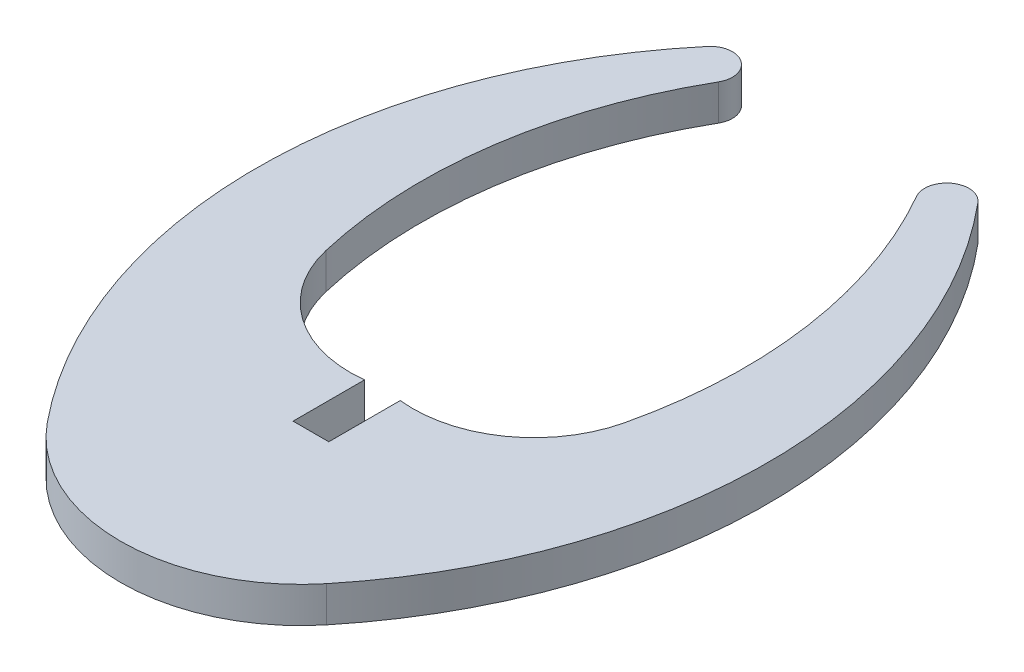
ISO-10303-21;
HEADER;
FILE_DESCRIPTION(('STEP AP214'),'2;1');
FILE_NAME('part.step','',(''),(''),'','','');
FILE_SCHEMA(('AUTOMOTIVE_DESIGN { 1 0 10303 214 1 1 1 1 }'));
ENDSEC;
DATA;
#1=APPLICATION_CONTEXT('core data for automotive mechanical design processes');
#2=APPLICATION_PROTOCOL_DEFINITION('international standard','automotive_design',2000,#1);
#3=PRODUCT_CONTEXT('',#1,'mechanical');
#4=PRODUCT('Part','Part','',(#3));
#5=PRODUCT_RELATED_PRODUCT_CATEGORY('part','',(#4));
#6=PRODUCT_DEFINITION_FORMATION('','',#4);
#7=PRODUCT_DEFINITION_CONTEXT('part definition',#1,'design');
#8=PRODUCT_DEFINITION('design','',#6,#7);
#9=PRODUCT_DEFINITION_SHAPE('','',#8);
#10=(LENGTH_UNIT() NAMED_UNIT(*) SI_UNIT(.MILLI.,.METRE.));
#11=(NAMED_UNIT(*) PLANE_ANGLE_UNIT() SI_UNIT($,.RADIAN.));
#12=(NAMED_UNIT(*) SI_UNIT($,.STERADIAN.) SOLID_ANGLE_UNIT());
#13=UNCERTAINTY_MEASURE_WITH_UNIT(LENGTH_MEASURE(1.E-05),#10,'distance_accuracy_value','');
#14=(GEOMETRIC_REPRESENTATION_CONTEXT(3) GLOBAL_UNCERTAINTY_ASSIGNED_CONTEXT((#13)) GLOBAL_UNIT_ASSIGNED_CONTEXT((#10,
#11,#12)) REPRESENTATION_CONTEXT('',''));
#15=CARTESIAN_POINT('',(0.,0.,0.));
#16=DIRECTION('',(0.,0.,1.));
#17=DIRECTION('',(1.,0.,0.));
#18=AXIS2_PLACEMENT_3D('',#15,#16,#17);
#19=CARTESIAN_POINT('',(-41813.701197,3.,-18401.092482));
#20=DIRECTION('',(-0.999999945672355,0.,0.000329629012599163));
#21=DIRECTION('',(0.000329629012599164,0.,0.999999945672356));
#22=AXIS2_PLACEMENT_3D('',#19,#20,#21);
#23=PLANE('',#22);
#24=DIRECTION('',(-0.000329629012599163,0.,-0.999999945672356));
#25=VECTOR('',#24,1.);
#26=CARTESIAN_POINT('',(-41813.701197,0.,-18401.092482));
#27=LINE('',#26,#25);
#28=CARTESIAN_POINT('',(-41813.699219,0.,-18395.091797));
#29=VERTEX_POINT('',#28);
#30=CARTESIAN_POINT('',(-41813.701197,0.,-18401.092482));
#31=VERTEX_POINT('',#30);
#32=EDGE_CURVE('E156',#29,#31,#27,.T.);
#33=ORIENTED_EDGE('',*,*,#32,.T.);
#34=DIRECTION('',(0.,-1.,0.));
#35=VECTOR('',#34,1.);
#36=CARTESIAN_POINT('',(-41813.701197,3.,-18401.092482));
#37=LINE('',#36,#35);
#38=CARTESIAN_POINT('',(-41813.701197,3.,-18401.092482));
#39=VERTEX_POINT('',#38);
#40=EDGE_CURVE('E11',#39,#31,#37,.T.);
#41=ORIENTED_EDGE('',*,*,#40,.F.);
#42=DIRECTION('',(-0.000329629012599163,0.,-0.999999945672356));
#43=VECTOR('',#42,1.);
#44=CARTESIAN_POINT('',(-41813.701197,3.,-18401.092482));
#45=LINE('',#44,#43);
#46=CARTESIAN_POINT('',(-41813.699219,3.,-18395.091797));
#47=VERTEX_POINT('',#46);
#48=EDGE_CURVE('E178',#47,#39,#45,.T.);
#49=ORIENTED_EDGE('',*,*,#48,.F.);
#50=DIRECTION('',(0.,-1.,0.));
#51=VECTOR('',#50,1.);
#52=CARTESIAN_POINT('',(-41813.699219,3.,-18395.091797));
#53=LINE('',#52,#51);
#54=EDGE_CURVE('E152',#47,#29,#53,.T.);
#55=ORIENTED_EDGE('',*,*,#54,.T.);
#56=EDGE_LOOP('',(#33,#41,#49,#55));
#57=FACE_BOUND('',#56,.T.);
#58=ADVANCED_FACE('F36',(#57),#23,.F.);
#59=CARTESIAN_POINT('',(-41814.8306231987,3.,-18411.1923649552));
#60=DIRECTION('',(0.,-1.,0.));
#61=DIRECTION('',(0.,0.,-1.));
#62=AXIS2_PLACEMENT_3D('',#59,#60,#61);
#63=CYLINDRICAL_SURFACE('',#62,10.1628361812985);
#64=CARTESIAN_POINT('',(-41814.8306231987,0.,-18411.1923649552));
#65=DIRECTION('',(0.,-1.,0.));
#66=DIRECTION('',(0.,0.,1.));
#67=AXIS2_PLACEMENT_3D('',#64,#65,#66);
#68=CIRCLE('',#67,10.1628361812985);
#69=CARTESIAN_POINT('',(-41824.726251,0.,-18408.877243));
#70=VERTEX_POINT('',#69);
#71=EDGE_CURVE('E159',#31,#70,#68,.T.);
#72=ORIENTED_EDGE('',*,*,#71,.T.);
#73=DIRECTION('',(0.,-1.,0.));
#74=VECTOR('',#73,1.);
#75=CARTESIAN_POINT('',(-41824.726251,3.,-18408.877243));
#76=LINE('',#75,#74);
#77=CARTESIAN_POINT('',(-41824.726251,3.,-18408.877243));
#78=VERTEX_POINT('',#77);
#79=EDGE_CURVE('E44',#78,#70,#76,.T.);
#80=ORIENTED_EDGE('',*,*,#79,.F.);
#81=CARTESIAN_POINT('',(-41814.8306231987,3.,-18411.1923649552));
#82=DIRECTION('',(0.,-1.,0.));
#83=DIRECTION('',(0.,0.,1.));
#84=AXIS2_PLACEMENT_3D('',#81,#82,#83);
#85=CIRCLE('',#84,10.1628361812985);
#86=EDGE_CURVE('E107',#39,#78,#85,.T.);
#87=ORIENTED_EDGE('',*,*,#86,.F.);
#88=ORIENTED_EDGE('',*,*,#40,.T.);
#89=EDGE_LOOP('',(#72,#80,#87,#88));
#90=FACE_BOUND('',#89,.T.);
#91=ADVANCED_FACE('F256',(#90),#63,.F.);
#92=CARTESIAN_POINT('',(-41786.1759224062,3.,-18417.9052855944));
#93=DIRECTION('',(0.,-1.,0.));
#94=DIRECTION('',(0.,0.,-1.));
#95=AXIS2_PLACEMENT_3D('',#92,#93,#94);
#96=CYLINDRICAL_SURFACE('',#95,39.5933502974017);
#97=CARTESIAN_POINT('',(-41786.1759224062,0.,-18417.9052855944));
#98=DIRECTION('',(0.,-1.,0.));
#99=DIRECTION('',(0.,0.,1.));
#100=AXIS2_PLACEMENT_3D('',#97,#98,#99);
#101=CIRCLE('',#100,39.5933502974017);
#102=CARTESIAN_POINT('',(-41820.511795,0.,-18437.620286));
#103=VERTEX_POINT('',#102);
#104=EDGE_CURVE('E161',#70,#103,#101,.T.);
#105=ORIENTED_EDGE('',*,*,#104,.T.);
#106=DIRECTION('',(0.,-1.,0.));
#107=VECTOR('',#106,1.);
#108=CARTESIAN_POINT('',(-41820.511795,3.,-18437.620286));
#109=LINE('',#108,#107);
#110=CARTESIAN_POINT('',(-41820.511795,3.,-18437.620286));
#111=VERTEX_POINT('',#110);
#112=EDGE_CURVE('E197',#111,#103,#109,.T.);
#113=ORIENTED_EDGE('',*,*,#112,.F.);
#114=CARTESIAN_POINT('',(-41786.1759224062,3.,-18417.9052855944));
#115=DIRECTION('',(0.,-1.,0.));
#116=DIRECTION('',(0.,0.,1.));
#117=AXIS2_PLACEMENT_3D('',#114,#115,#116);
#118=CIRCLE('',#117,39.5933502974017);
#119=EDGE_CURVE('E205',#78,#111,#118,.T.);
#120=ORIENTED_EDGE('',*,*,#119,.F.);
#121=ORIENTED_EDGE('',*,*,#79,.T.);
#122=EDGE_LOOP('',(#105,#113,#120,#121));
#123=FACE_BOUND('',#122,.T.);
#124=ADVANCED_FACE('F203',(#123),#96,.F.);
#125=CARTESIAN_POINT('',(-41822.1254187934,3.,-18438.5452138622));
#126=DIRECTION('',(0.,-1.,0.));
#127=DIRECTION('',(0.,0.,-1.));
#128=AXIS2_PLACEMENT_3D('',#125,#126,#127);
#129=CYLINDRICAL_SURFACE('',#128,1.85991217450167);
#130=CARTESIAN_POINT('',(-41822.1254187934,0.,-18438.5452138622));
#131=DIRECTION('',(0.,1.,0.));
#132=DIRECTION('',(0.,0.,1.));
#133=AXIS2_PLACEMENT_3D('',#130,#131,#132);
#134=CIRCLE('',#133,1.85991217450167);
#135=CARTESIAN_POINT('',(-41823.551759,0.,-18439.738875));
#136=VERTEX_POINT('',#135);
#137=EDGE_CURVE('E163',#103,#136,#134,.T.);
#138=ORIENTED_EDGE('',*,*,#137,.T.);
#139=DIRECTION('',(0.,-1.,0.));
#140=VECTOR('',#139,1.);
#141=CARTESIAN_POINT('',(-41823.551759,3.,-18439.738875));
#142=LINE('',#141,#140);
#143=CARTESIAN_POINT('',(-41823.551759,3.,-18439.738875));
#144=VERTEX_POINT('',#143);
#145=EDGE_CURVE('E194',#144,#136,#142,.T.);
#146=ORIENTED_EDGE('',*,*,#145,.F.);
#147=CARTESIAN_POINT('',(-41822.1254187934,3.,-18438.5452138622));
#148=DIRECTION('',(0.,1.,0.));
#149=DIRECTION('',(0.,0.,1.));
#150=AXIS2_PLACEMENT_3D('',#147,#148,#149);
#151=CIRCLE('',#150,1.85991217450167);
#152=EDGE_CURVE('E223',#111,#144,#151,.T.);
#153=ORIENTED_EDGE('',*,*,#152,.F.);
#154=ORIENTED_EDGE('',*,*,#112,.T.);
#155=EDGE_LOOP('',(#138,#146,#153,#154));
#156=FACE_BOUND('',#155,.T.);
#157=ADVANCED_FACE('F214',(#156),#129,.T.);
#158=CARTESIAN_POINT('',(-41790.429705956,3.,-18411.9835689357));
#159=DIRECTION('',(0.,-1.,0.));
#160=DIRECTION('',(0.,0.,-1.));
#161=AXIS2_PLACEMENT_3D('',#158,#159,#160);
#162=CYLINDRICAL_SURFACE('',#161,43.2137410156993);
#163=CARTESIAN_POINT('',(-41790.429705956,0.,-18411.9835689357));
#164=DIRECTION('',(0.,1.,0.));
#165=DIRECTION('',(0.,0.,1.));
#166=AXIS2_PLACEMENT_3D('',#163,#164,#165);
#167=CIRCLE('',#166,43.2137410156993);
#168=CARTESIAN_POINT('',(-41823.929996,0.,-18384.685987));
#169=VERTEX_POINT('',#168);
#170=EDGE_CURVE('E165',#136,#169,#167,.T.);
#171=ORIENTED_EDGE('',*,*,#170,.T.);
#172=DIRECTION('',(0.,-1.,0.));
#173=VECTOR('',#172,1.);
#174=CARTESIAN_POINT('',(-41823.929996,3.,-18384.685987));
#175=LINE('',#174,#173);
#176=CARTESIAN_POINT('',(-41823.929996,3.,-18384.685987));
#177=VERTEX_POINT('',#176);
#178=EDGE_CURVE('E191',#177,#169,#175,.T.);
#179=ORIENTED_EDGE('',*,*,#178,.F.);
#180=CARTESIAN_POINT('',(-41790.429705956,3.,-18411.9835689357));
#181=DIRECTION('',(0.,1.,0.));
#182=DIRECTION('',(0.,0.,1.));
#183=AXIS2_PLACEMENT_3D('',#180,#181,#182);
#184=CIRCLE('',#183,43.2137410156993);
#185=EDGE_CURVE('E220',#144,#177,#184,.T.);
#186=ORIENTED_EDGE('',*,*,#185,.F.);
#187=ORIENTED_EDGE('',*,*,#145,.T.);
#188=EDGE_LOOP('',(#171,#179,#186,#187));
#189=FACE_BOUND('',#188,.T.);
#190=ADVANCED_FACE('F218',(#189),#162,.T.);
#191=CARTESIAN_POINT('',(-41812.2019220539,3.,-18394.2441408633));
#192=DIRECTION('',(0.,-1.,0.));
#193=DIRECTION('',(0.,0.,-1.));
#194=AXIS2_PLACEMENT_3D('',#191,#192,#193);
#195=CYLINDRICAL_SURFACE('',#194,15.1296405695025);
#196=CARTESIAN_POINT('',(-41812.2019220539,0.,-18394.2441408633));
#197=DIRECTION('',(0.,1.,0.));
#198=DIRECTION('',(0.,0.,1.));
#199=AXIS2_PLACEMENT_3D('',#196,#197,#198);
#200=CIRCLE('',#199,15.1296405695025);
#201=CARTESIAN_POINT('',(-41800.475939,0.,-18384.683422));
#202=VERTEX_POINT('',#201);
#203=EDGE_CURVE('E167',#169,#202,#200,.T.);
#204=ORIENTED_EDGE('',*,*,#203,.T.);
#205=DIRECTION('',(0.,-1.,0.));
#206=VECTOR('',#205,1.);
#207=CARTESIAN_POINT('',(-41800.475939,3.,-18384.683422));
#208=LINE('',#207,#206);
#209=CARTESIAN_POINT('',(-41800.475939,3.,-18384.683422));
#210=VERTEX_POINT('',#209);
#211=EDGE_CURVE('E188',#210,#202,#208,.T.);
#212=ORIENTED_EDGE('',*,*,#211,.F.);
#213=CARTESIAN_POINT('',(-41812.2019220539,3.,-18394.2441408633));
#214=DIRECTION('',(0.,1.,0.));
#215=DIRECTION('',(0.,0.,1.));
#216=AXIS2_PLACEMENT_3D('',#213,#214,#215);
#217=CIRCLE('',#216,15.1296405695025);
#218=EDGE_CURVE('E222',#177,#210,#217,.T.);
#219=ORIENTED_EDGE('',*,*,#218,.F.);
#220=ORIENTED_EDGE('',*,*,#178,.T.);
#221=EDGE_LOOP('',(#204,#212,#219,#220));
#222=FACE_BOUND('',#221,.T.);
#223=ADVANCED_FACE('F269',(#222),#195,.T.);
#224=CARTESIAN_POINT('',(-41833.964830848,3.,-18411.9901837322));
#225=DIRECTION('',(0.,-1.,0.));
#226=DIRECTION('',(0.,0.,-1.));
#227=AXIS2_PLACEMENT_3D('',#224,#225,#226);
#228=CYLINDRICAL_SURFACE('',#227,43.2107060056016);
#229=CARTESIAN_POINT('',(-41833.964830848,0.,-18411.9901837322));
#230=DIRECTION('',(0.,1.,0.));
#231=DIRECTION('',(0.,0.,1.));
#232=AXIS2_PLACEMENT_3D('',#229,#230,#231);
#233=CIRCLE('',#232,43.2107060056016);
#234=CARTESIAN_POINT('',(-41800.837363,0.,-18439.7343000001));
#235=VERTEX_POINT('',#234);
#236=EDGE_CURVE('E169',#202,#235,#233,.T.);
#237=ORIENTED_EDGE('',*,*,#236,.T.);
#238=DIRECTION('',(0.,-1.,0.));
#239=VECTOR('',#238,1.);
#240=CARTESIAN_POINT('',(-41800.837363,3.,-18439.7343000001));
#241=LINE('',#240,#239);
#242=CARTESIAN_POINT('',(-41800.837363,3.,-18439.7343000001));
#243=VERTEX_POINT('',#242);
#244=EDGE_CURVE('E185',#243,#235,#241,.T.);
#245=ORIENTED_EDGE('',*,*,#244,.F.);
#246=CARTESIAN_POINT('',(-41833.964830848,3.,-18411.9901837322));
#247=DIRECTION('',(0.,1.,0.));
#248=DIRECTION('',(0.,0.,1.));
#249=AXIS2_PLACEMENT_3D('',#246,#247,#248);
#250=CIRCLE('',#249,43.2107060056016);
#251=EDGE_CURVE('E225',#210,#243,#250,.T.);
#252=ORIENTED_EDGE('',*,*,#251,.F.);
#253=ORIENTED_EDGE('',*,*,#211,.T.);
#254=EDGE_LOOP('',(#237,#245,#252,#253));
#255=FACE_BOUND('',#254,.T.);
#256=ADVANCED_FACE('F272',(#255),#228,.T.);
#257=CARTESIAN_POINT('',(-41802.2600175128,3.,-18438.5402495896));
#258=DIRECTION('',(0.,-1.,0.));
#259=DIRECTION('',(0.,0.,-1.));
#260=AXIS2_PLACEMENT_3D('',#257,#258,#259);
#261=CYLINDRICAL_SURFACE('',#260,1.8573374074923);
#262=CARTESIAN_POINT('',(-41802.2600175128,0.,-18438.5402495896));
#263=DIRECTION('',(0.,1.,0.));
#264=DIRECTION('',(0.,0.,1.));
#265=AXIS2_PLACEMENT_3D('',#262,#263,#264);
#266=CIRCLE('',#265,1.8573374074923);
#267=CARTESIAN_POINT('',(-41803.871416,0.,-18437.616617));
#268=VERTEX_POINT('',#267);
#269=EDGE_CURVE('E171',#235,#268,#266,.T.);
#270=ORIENTED_EDGE('',*,*,#269,.T.);
#271=DIRECTION('',(0.,-1.,0.));
#272=VECTOR('',#271,1.);
#273=CARTESIAN_POINT('',(-41803.871416,3.,-18437.616617));
#274=LINE('',#273,#272);
#275=CARTESIAN_POINT('',(-41803.871416,3.,-18437.616617));
#276=VERTEX_POINT('',#275);
#277=EDGE_CURVE('E182',#276,#268,#274,.T.);
#278=ORIENTED_EDGE('',*,*,#277,.F.);
#279=CARTESIAN_POINT('',(-41802.2600175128,3.,-18438.5402495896));
#280=DIRECTION('',(0.,1.,0.));
#281=DIRECTION('',(0.,0.,1.));
#282=AXIS2_PLACEMENT_3D('',#279,#280,#281);
#283=CIRCLE('',#282,1.8573374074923);
#284=EDGE_CURVE('E231',#243,#276,#283,.T.);
#285=ORIENTED_EDGE('',*,*,#284,.F.);
#286=ORIENTED_EDGE('',*,*,#244,.T.);
#287=EDGE_LOOP('',(#270,#278,#285,#286));
#288=FACE_BOUND('',#287,.T.);
#289=ADVANCED_FACE('F237',(#288),#261,.T.);
#290=CARTESIAN_POINT('',(-41838.2155407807,3.,-18417.9188290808));
#291=DIRECTION('',(0.,-1.,0.));
#292=DIRECTION('',(0.,0.,-1.));
#293=AXIS2_PLACEMENT_3D('',#290,#291,#292);
#294=CYLINDRICAL_SURFACE('',#293,39.5919405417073);
#295=CARTESIAN_POINT('',(-41838.2155407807,0.,-18417.9188290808));
#296=DIRECTION('',(0.,-1.,0.));
#297=DIRECTION('',(0.,0.,1.));
#298=AXIS2_PLACEMENT_3D('',#295,#296,#297);
#299=CIRCLE('',#298,39.5919405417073);
#300=CARTESIAN_POINT('',(-41799.670382,0.,-18408.874909));
#301=VERTEX_POINT('',#300);
#302=EDGE_CURVE('E173',#268,#301,#299,.T.);
#303=ORIENTED_EDGE('',*,*,#302,.T.);
#304=DIRECTION('',(0.,-1.,0.));
#305=VECTOR('',#304,1.);
#306=CARTESIAN_POINT('',(-41799.670382,3.,-18408.874909));
#307=LINE('',#306,#305);
#308=CARTESIAN_POINT('',(-41799.670382,3.,-18408.874909));
#309=VERTEX_POINT('',#308);
#310=EDGE_CURVE('E147',#309,#301,#307,.T.);
#311=ORIENTED_EDGE('',*,*,#310,.F.);
#312=CARTESIAN_POINT('',(-41838.2155407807,3.,-18417.9188290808));
#313=DIRECTION('',(0.,-1.,0.));
#314=DIRECTION('',(0.,0.,1.));
#315=AXIS2_PLACEMENT_3D('',#312,#313,#314);
#316=CIRCLE('',#315,39.5919405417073);
#317=EDGE_CURVE('E138',#276,#309,#316,.T.);
#318=ORIENTED_EDGE('',*,*,#317,.F.);
#319=ORIENTED_EDGE('',*,*,#277,.T.);
#320=EDGE_LOOP('',(#303,#311,#318,#319));
#321=FACE_BOUND('',#320,.T.);
#322=ADVANCED_FACE('F241',(#321),#294,.F.);
#323=CARTESIAN_POINT('',(-41809.566960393,3.,-18411.1929677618));
#324=DIRECTION('',(0.,-1.,0.));
#325=DIRECTION('',(0.,0.,-1.));
#326=AXIS2_PLACEMENT_3D('',#323,#324,#325);
#327=CYLINDRICAL_SURFACE('',#326,10.1644311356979);
#328=CARTESIAN_POINT('',(-41809.566960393,0.,-18411.1929677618));
#329=DIRECTION('',(0.,-1.,0.));
#330=DIRECTION('',(0.,0.,1.));
#331=AXIS2_PLACEMENT_3D('',#328,#329,#330);
#332=CIRCLE('',#331,10.1644311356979);
#333=CARTESIAN_POINT('',(-41810.699219,0.,-18401.091797));
#334=VERTEX_POINT('',#333);
#335=EDGE_CURVE('E146',#301,#334,#332,.T.);
#336=ORIENTED_EDGE('',*,*,#335,.T.);
#337=DIRECTION('',(0.,-1.,0.));
#338=VECTOR('',#337,1.);
#339=CARTESIAN_POINT('',(-41810.699219,3.,-18401.091797));
#340=LINE('',#339,#338);
#341=CARTESIAN_POINT('',(-41810.699219,3.,-18401.091797));
#342=VERTEX_POINT('',#341);
#343=EDGE_CURVE('E143',#342,#334,#340,.T.);
#344=ORIENTED_EDGE('',*,*,#343,.F.);
#345=CARTESIAN_POINT('',(-41809.566960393,3.,-18411.1929677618));
#346=DIRECTION('',(0.,-1.,0.));
#347=DIRECTION('',(0.,0.,1.));
#348=AXIS2_PLACEMENT_3D('',#345,#346,#347);
#349=CIRCLE('',#348,10.1644311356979);
#350=EDGE_CURVE('E132',#309,#342,#349,.T.);
#351=ORIENTED_EDGE('',*,*,#350,.F.);
#352=ORIENTED_EDGE('',*,*,#310,.T.);
#353=EDGE_LOOP('',(#336,#344,#351,#352));
#354=FACE_BOUND('',#353,.T.);
#355=ADVANCED_FACE('F144',(#354),#327,.F.);
#356=CARTESIAN_POINT('',(-41810.699219,3.,-18395.091797));
#357=DIRECTION('',(1.,0.,0.));
#358=DIRECTION('',(0.,0.,-1.));
#359=AXIS2_PLACEMENT_3D('',#356,#357,#358);
#360=PLANE('',#359);
#361=DIRECTION('',(0.,0.,1.));
#362=VECTOR('',#361,1.);
#363=CARTESIAN_POINT('',(-41810.699219,0.,-18395.091797));
#364=LINE('',#363,#362);
#365=CARTESIAN_POINT('',(-41810.699219,0.,-18395.091797));
#366=VERTEX_POINT('',#365);
#367=EDGE_CURVE('E93',#334,#366,#364,.T.);
#368=ORIENTED_EDGE('',*,*,#367,.T.);
#369=DIRECTION('',(0.,-1.,0.));
#370=VECTOR('',#369,1.);
#371=CARTESIAN_POINT('',(-41810.699219,3.,-18395.091797));
#372=LINE('',#371,#370);
#373=CARTESIAN_POINT('',(-41810.699219,3.,-18395.091797));
#374=VERTEX_POINT('',#373);
#375=EDGE_CURVE('E148',#374,#366,#372,.T.);
#376=ORIENTED_EDGE('',*,*,#375,.F.);
#377=DIRECTION('',(0.,0.,1.));
#378=VECTOR('',#377,1.);
#379=CARTESIAN_POINT('',(-41810.699219,3.,-18395.091797));
#380=LINE('',#379,#378);
#381=EDGE_CURVE('E136',#342,#374,#380,.T.);
#382=ORIENTED_EDGE('',*,*,#381,.F.);
#383=ORIENTED_EDGE('',*,*,#343,.T.);
#384=EDGE_LOOP('',(#368,#376,#382,#383));
#385=FACE_BOUND('',#384,.T.);
#386=ADVANCED_FACE('F150',(#385),#360,.F.);
#387=CARTESIAN_POINT('',(-41813.699219,3.,-18395.091797));
#388=DIRECTION('',(0.,0.,1.));
#389=DIRECTION('',(1.,0.,0.));
#390=AXIS2_PLACEMENT_3D('',#387,#388,#389);
#391=PLANE('',#390);
#392=DIRECTION('',(-1.,0.,0.));
#393=VECTOR('',#392,1.);
#394=CARTESIAN_POINT('',(-41813.699219,0.,-18395.091797));
#395=LINE('',#394,#393);
#396=EDGE_CURVE('E99',#366,#29,#395,.T.);
#397=ORIENTED_EDGE('',*,*,#396,.T.);
#398=ORIENTED_EDGE('',*,*,#54,.F.);
#399=DIRECTION('',(-1.,0.,0.));
#400=VECTOR('',#399,1.);
#401=CARTESIAN_POINT('',(-41813.699219,3.,-18395.091797));
#402=LINE('',#401,#400);
#403=EDGE_CURVE('E52',#374,#47,#402,.T.);
#404=ORIENTED_EDGE('',*,*,#403,.F.);
#405=ORIENTED_EDGE('',*,*,#375,.T.);
#406=EDGE_LOOP('',(#397,#398,#404,#405));
#407=FACE_BOUND('',#406,.T.);
#408=ADVANCED_FACE('F245',(#407),#391,.F.);
#409=CARTESIAN_POINT('',(-41809.566960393,3.,-18411.1929677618));
#410=DIRECTION('',(0.,1.,0.));
#411=DIRECTION('',(0.,0.,1.));
#412=AXIS2_PLACEMENT_3D('',#409,#410,#411);
#413=PLANE('',#412);
#414=ORIENTED_EDGE('',*,*,#48,.T.);
#415=ORIENTED_EDGE('',*,*,#86,.T.);
#416=ORIENTED_EDGE('',*,*,#119,.T.);
#417=ORIENTED_EDGE('',*,*,#152,.T.);
#418=ORIENTED_EDGE('',*,*,#185,.T.);
#419=ORIENTED_EDGE('',*,*,#218,.T.);
#420=ORIENTED_EDGE('',*,*,#251,.T.);
#421=ORIENTED_EDGE('',*,*,#284,.T.);
#422=ORIENTED_EDGE('',*,*,#317,.T.);
#423=ORIENTED_EDGE('',*,*,#350,.T.);
#424=ORIENTED_EDGE('',*,*,#381,.T.);
#425=ORIENTED_EDGE('',*,*,#403,.T.);
#426=EDGE_LOOP('',(#414,#415,#416,#417,#418,#419,#420,#421,#422,#423,#424,#425));
#427=FACE_BOUND('',#426,.T.);
#428=ADVANCED_FACE('F134',(#427),#413,.T.);
#429=CARTESIAN_POINT('',(-41809.566960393,0.,-18411.1929677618));
#430=DIRECTION('',(0.,1.,0.));
#431=DIRECTION('',(0.,0.,1.));
#432=AXIS2_PLACEMENT_3D('',#429,#430,#431);
#433=PLANE('',#432);
#434=ORIENTED_EDGE('',*,*,#32,.F.);
#435=ORIENTED_EDGE('',*,*,#396,.F.);
#436=ORIENTED_EDGE('',*,*,#367,.F.);
#437=ORIENTED_EDGE('',*,*,#335,.F.);
#438=ORIENTED_EDGE('',*,*,#302,.F.);
#439=ORIENTED_EDGE('',*,*,#269,.F.);
#440=ORIENTED_EDGE('',*,*,#236,.F.);
#441=ORIENTED_EDGE('',*,*,#203,.F.);
#442=ORIENTED_EDGE('',*,*,#170,.F.);
#443=ORIENTED_EDGE('',*,*,#137,.F.);
#444=ORIENTED_EDGE('',*,*,#104,.F.);
#445=ORIENTED_EDGE('',*,*,#71,.F.);
#446=EDGE_LOOP('',(#434,#435,#436,#437,#438,#439,#440,#441,#442,#443,#444,#445));
#447=FACE_BOUND('',#446,.T.);
#448=ADVANCED_FACE('F209',(#447),#433,.F.);
#449=CLOSED_SHELL('',(#58,#91,#124,#157,#190,#223,#256,#289,#322,#355,#386,#408,#428,#448));
#450=MANIFOLD_SOLID_BREP('B2',#449);
#451=ADVANCED_BREP_SHAPE_REPRESENTATION('',(#18,#450),#14);
#452=SHAPE_DEFINITION_REPRESENTATION(#9,#451);
ENDSEC;
END-ISO-10303-21;
